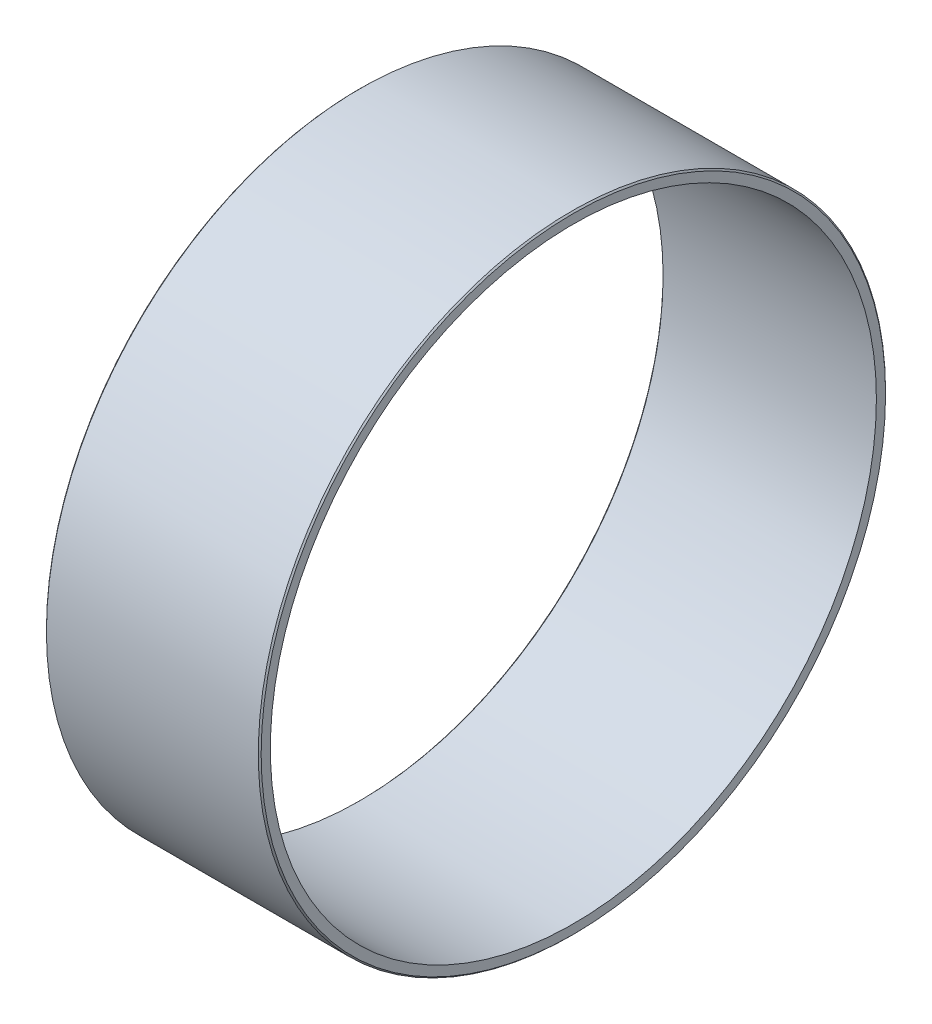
ISO-10303-21;
HEADER;
FILE_DESCRIPTION(('STEP AP214'),'2;1');
FILE_NAME('part.step','',(''),(''),'','','');
FILE_SCHEMA(('AUTOMOTIVE_DESIGN { 1 0 10303 214 1 1 1 1 }'));
ENDSEC;
DATA;
#1=APPLICATION_CONTEXT('core data for automotive mechanical design processes');
#2=APPLICATION_PROTOCOL_DEFINITION('international standard','automotive_design',2000,#1);
#3=PRODUCT_CONTEXT('',#1,'mechanical');
#4=PRODUCT('Part','Part','',(#3));
#5=PRODUCT_RELATED_PRODUCT_CATEGORY('part','',(#4));
#6=PRODUCT_DEFINITION_FORMATION('','',#4);
#7=PRODUCT_DEFINITION_CONTEXT('part definition',#1,'design');
#8=PRODUCT_DEFINITION('design','',#6,#7);
#9=PRODUCT_DEFINITION_SHAPE('','',#8);
#10=(LENGTH_UNIT() NAMED_UNIT(*) SI_UNIT(.MILLI.,.METRE.));
#11=(NAMED_UNIT(*) PLANE_ANGLE_UNIT() SI_UNIT($,.RADIAN.));
#12=(NAMED_UNIT(*) SI_UNIT($,.STERADIAN.) SOLID_ANGLE_UNIT());
#13=UNCERTAINTY_MEASURE_WITH_UNIT(LENGTH_MEASURE(1.E-05),#10,'distance_accuracy_value','');
#14=(GEOMETRIC_REPRESENTATION_CONTEXT(3) GLOBAL_UNCERTAINTY_ASSIGNED_CONTEXT((#13)) GLOBAL_UNIT_ASSIGNED_CONTEXT((#10,
#11,#12)) REPRESENTATION_CONTEXT('',''));
#15=CARTESIAN_POINT('',(0.,0.,0.));
#16=DIRECTION('',(0.,0.,1.));
#17=DIRECTION('',(1.,0.,0.));
#18=AXIS2_PLACEMENT_3D('',#15,#16,#17);
#19=CARTESIAN_POINT('',(0.,0.,0.));
#20=DIRECTION('',(1.,0.,0.));
#21=DIRECTION('',(0.,0.,-1.));
#22=AXIS2_PLACEMENT_3D('',#19,#20,#21);
#23=CYLINDRICAL_SURFACE('',#22,105.84);
#24=CARTESIAN_POINT('',(-74.5,0.,0.));
#25=DIRECTION('',(-1.,0.,0.));
#26=DIRECTION('',(0.,0.,1.));
#27=AXIS2_PLACEMENT_3D('',#24,#25,#26);
#28=CIRCLE('',#27,105.84);
#29=CARTESIAN_POINT('',(-74.5,0.,105.84));
#30=VERTEX_POINT('',#29);
#31=EDGE_CURVE('E51',#30,#30,#28,.T.);
#32=ORIENTED_EDGE('',*,*,#31,.T.);
#33=EDGE_LOOP('',(#32));
#34=FACE_BOUND('',#33,.T.);
#35=CARTESIAN_POINT('',(0.,0.,0.));
#36=DIRECTION('',(1.,0.,0.));
#37=DIRECTION('',(0.,0.,-1.));
#38=AXIS2_PLACEMENT_3D('',#35,#36,#37);
#39=CIRCLE('',#38,105.84);
#40=CARTESIAN_POINT('',(0.,0.,-105.84));
#41=VERTEX_POINT('',#40);
#42=EDGE_CURVE('E62',#41,#41,#39,.T.);
#43=ORIENTED_EDGE('',*,*,#42,.T.);
#44=EDGE_LOOP('',(#43));
#45=FACE_BOUND('',#44,.T.);
#46=ADVANCED_FACE('F36',(#34,#45),#23,.F.);
#47=CARTESIAN_POINT('',(0.,105.84,0.));
#48=DIRECTION('',(1.,0.,0.));
#49=DIRECTION('',(0.,0.,-1.));
#50=AXIS2_PLACEMENT_3D('',#47,#48,#49);
#51=PLANE('',#50);
#52=CARTESIAN_POINT('',(0.,0.,0.));
#53=DIRECTION('',(1.,0.,0.));
#54=DIRECTION('',(0.,0.,-1.));
#55=AXIS2_PLACEMENT_3D('',#52,#53,#54);
#56=CIRCLE('',#55,109.05);
#57=CARTESIAN_POINT('',(0.,0.,-109.05));
#58=VERTEX_POINT('',#57);
#59=EDGE_CURVE('E43',#58,#58,#56,.T.);
#60=ORIENTED_EDGE('',*,*,#59,.T.);
#61=EDGE_LOOP('',(#60));
#62=FACE_BOUND('',#61,.T.);
#63=ORIENTED_EDGE('',*,*,#42,.F.);
#64=EDGE_LOOP('',(#63));
#65=FACE_BOUND('',#64,.T.);
#66=ADVANCED_FACE('F67',(#62,#65),#51,.T.);
#67=CARTESIAN_POINT('',(0.,0.,0.));
#68=DIRECTION('',(1.,0.,0.));
#69=DIRECTION('',(0.,0.,-1.));
#70=AXIS2_PLACEMENT_3D('',#67,#68,#69);
#71=CYLINDRICAL_SURFACE('',#70,109.55);
#72=CARTESIAN_POINT('',(-0.499999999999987,0.,0.));
#73=DIRECTION('',(1.,0.,0.));
#74=DIRECTION('',(0.,0.,-1.));
#75=AXIS2_PLACEMENT_3D('',#72,#73,#74);
#76=CIRCLE('',#75,109.55);
#77=CARTESIAN_POINT('',(-0.499999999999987,0.,-109.55));
#78=VERTEX_POINT('',#77);
#79=EDGE_CURVE('E10',#78,#78,#76,.F.);
#80=ORIENTED_EDGE('',*,*,#79,.T.);
#81=EDGE_LOOP('',(#80));
#82=FACE_BOUND('',#81,.T.);
#83=CARTESIAN_POINT('',(-74.5,0.,0.));
#84=DIRECTION('',(-1.,0.,0.));
#85=DIRECTION('',(0.,0.,1.));
#86=AXIS2_PLACEMENT_3D('',#83,#84,#85);
#87=CIRCLE('',#86,109.55);
#88=CARTESIAN_POINT('',(-74.5,0.,109.55));
#89=VERTEX_POINT('',#88);
#90=EDGE_CURVE('E47',#89,#89,#87,.F.);
#91=ORIENTED_EDGE('',*,*,#90,.T.);
#92=EDGE_LOOP('',(#91));
#93=FACE_BOUND('',#92,.T.);
#94=ADVANCED_FACE('F69',(#82,#93),#71,.T.);
#95=CARTESIAN_POINT('',(-75.,109.55,0.));
#96=DIRECTION('',(-1.,0.,0.));
#97=DIRECTION('',(0.,0.,1.));
#98=AXIS2_PLACEMENT_3D('',#95,#96,#97);
#99=PLANE('',#98);
#100=CARTESIAN_POINT('',(-75.,0.,0.));
#101=DIRECTION('',(-1.,0.,0.));
#102=DIRECTION('',(0.,0.,1.));
#103=AXIS2_PLACEMENT_3D('',#100,#101,#102);
#104=CIRCLE('',#103,106.34);
#105=CARTESIAN_POINT('',(-75.,0.,106.34));
#106=VERTEX_POINT('',#105);
#107=EDGE_CURVE('E56',#106,#106,#104,.F.);
#108=ORIENTED_EDGE('',*,*,#107,.T.);
#109=EDGE_LOOP('',(#108));
#110=FACE_BOUND('',#109,.T.);
#111=CARTESIAN_POINT('',(-75.,0.,0.));
#112=DIRECTION('',(-1.,0.,0.));
#113=DIRECTION('',(0.,0.,1.));
#114=AXIS2_PLACEMENT_3D('',#111,#112,#113);
#115=CIRCLE('',#114,109.05);
#116=CARTESIAN_POINT('',(-75.,0.,109.05));
#117=VERTEX_POINT('',#116);
#118=EDGE_CURVE('E59',#117,#117,#115,.T.);
#119=ORIENTED_EDGE('',*,*,#118,.T.);
#120=EDGE_LOOP('',(#119));
#121=FACE_BOUND('',#120,.T.);
#122=ADVANCED_FACE('F75',(#110,#121),#99,.T.);
#123=CARTESIAN_POINT('',(-75.,0.,0.));
#124=DIRECTION('',(-1.,0.,0.));
#125=DIRECTION('',(0.,0.,1.));
#126=AXIS2_PLACEMENT_3D('',#123,#124,#125);
#127=CONICAL_SURFACE('',#126,106.34,0.785398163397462);
#128=ORIENTED_EDGE('',*,*,#31,.F.);
#129=EDGE_LOOP('',(#128));
#130=FACE_BOUND('',#129,.T.);
#131=ORIENTED_EDGE('',*,*,#107,.F.);
#132=EDGE_LOOP('',(#131));
#133=FACE_BOUND('',#132,.T.);
#134=ADVANCED_FACE('F81',(#130,#133),#127,.F.);
#135=CARTESIAN_POINT('',(-74.5,0.,0.));
#136=DIRECTION('',(1.,0.,0.));
#137=DIRECTION('',(0.,0.,-1.));
#138=AXIS2_PLACEMENT_3D('',#135,#136,#137);
#139=CONICAL_SURFACE('',#138,109.55,0.785398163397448);
#140=ORIENTED_EDGE('',*,*,#118,.F.);
#141=EDGE_LOOP('',(#140));
#142=FACE_BOUND('',#141,.T.);
#143=ORIENTED_EDGE('',*,*,#90,.F.);
#144=EDGE_LOOP('',(#143));
#145=FACE_BOUND('',#144,.T.);
#146=ADVANCED_FACE('F83',(#142,#145),#139,.T.);
#147=CARTESIAN_POINT('',(0.,0.,0.));
#148=DIRECTION('',(-1.,0.,0.));
#149=DIRECTION('',(0.,0.,1.));
#150=AXIS2_PLACEMENT_3D('',#147,#148,#149);
#151=CONICAL_SURFACE('',#150,109.05,0.785398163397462);
#152=ORIENTED_EDGE('',*,*,#79,.F.);
#153=EDGE_LOOP('',(#152));
#154=FACE_BOUND('',#153,.T.);
#155=ORIENTED_EDGE('',*,*,#59,.F.);
#156=EDGE_LOOP('',(#155));
#157=FACE_BOUND('',#156,.T.);
#158=ADVANCED_FACE('F38',(#154,#157),#151,.T.);
#159=CLOSED_SHELL('',(#46,#66,#94,#122,#134,#146,#158));
#160=MANIFOLD_SOLID_BREP('B2',#159);
#161=ADVANCED_BREP_SHAPE_REPRESENTATION('',(#18,#160),#14);
#162=SHAPE_DEFINITION_REPRESENTATION(#9,#161);
ENDSEC;
END-ISO-10303-21;
